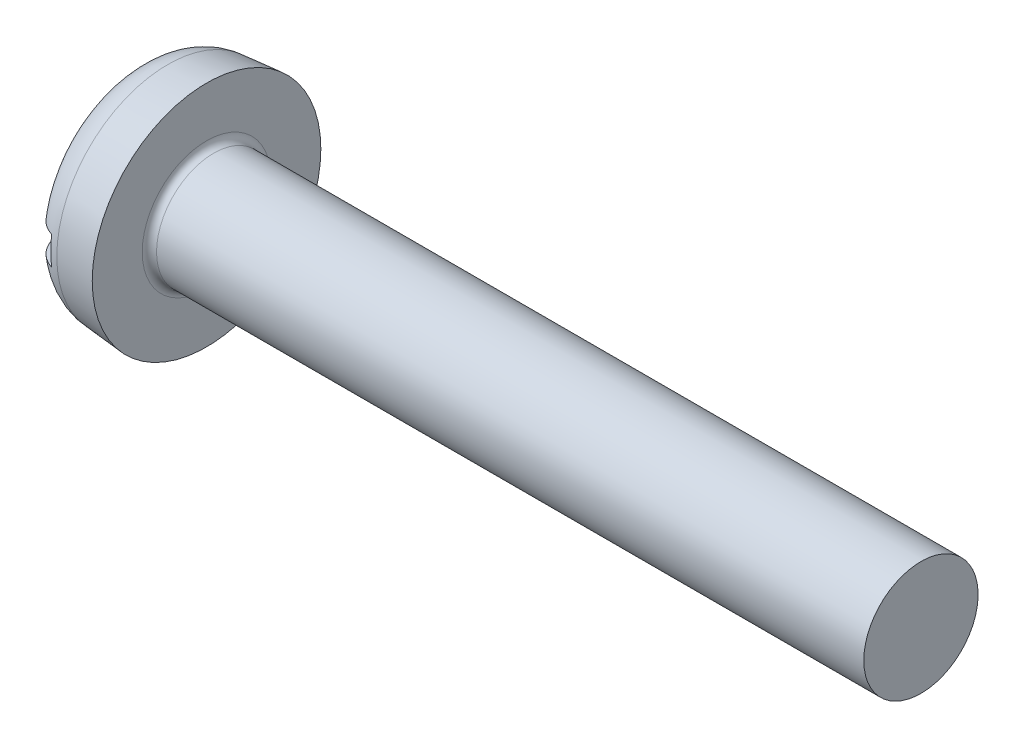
from build123d import *

# Parameters (mm, degrees)
FILLET1_R     = 0.1
HEAD_RADIUS_R = 0.5
SLOTSKE_W     = 3.2
SLOTSKE_H     = 0.4
SLOT_DEPTH    = 0.35


with BuildPart() as part:
    # BodySke → BaseBody (revolve)
    with BuildSketch(Plane.XY, mode=Mode.PRIVATE) as basebody_sk:
        Polygon((0, 0), (0, 1.512511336), (1, 1.6), (1, 0.8), (11, 0.8), (11, 0), align=None)
    revolve(basebody_sk.sketch.rotate(Axis((0, 0, 0), (1, 0, 0)), 90), axis=Axis((0, 0, 0), (1, 0, 0)))

    # Fillet1
    fillet1_edges = [part.edges().sort_by_distance(p)[0] for p in [
        (1, 0, -0.8),
    ]]
    fillet(fillet1_edges, radius=FILLET1_R)

    # Head_Radius
    head_radius_edges = [part.edges().sort_by_distance(p)[0] for p in [
        (0, 0, -1.512511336),
    ]]
    fillet(head_radius_edges, radius=HEAD_RADIUS_R)

    # SlotSke → Slot (cut)
    with BuildSketch(Plane(origin=(0, 0, 0), x_dir=(0, 0, -1), z_dir=(1, 0, 0))):
        Rectangle(SLOTSKE_W, SLOTSKE_H)
    extrude(amount=SLOT_DEPTH, mode=Mode.SUBTRACT)


solid = part.part
